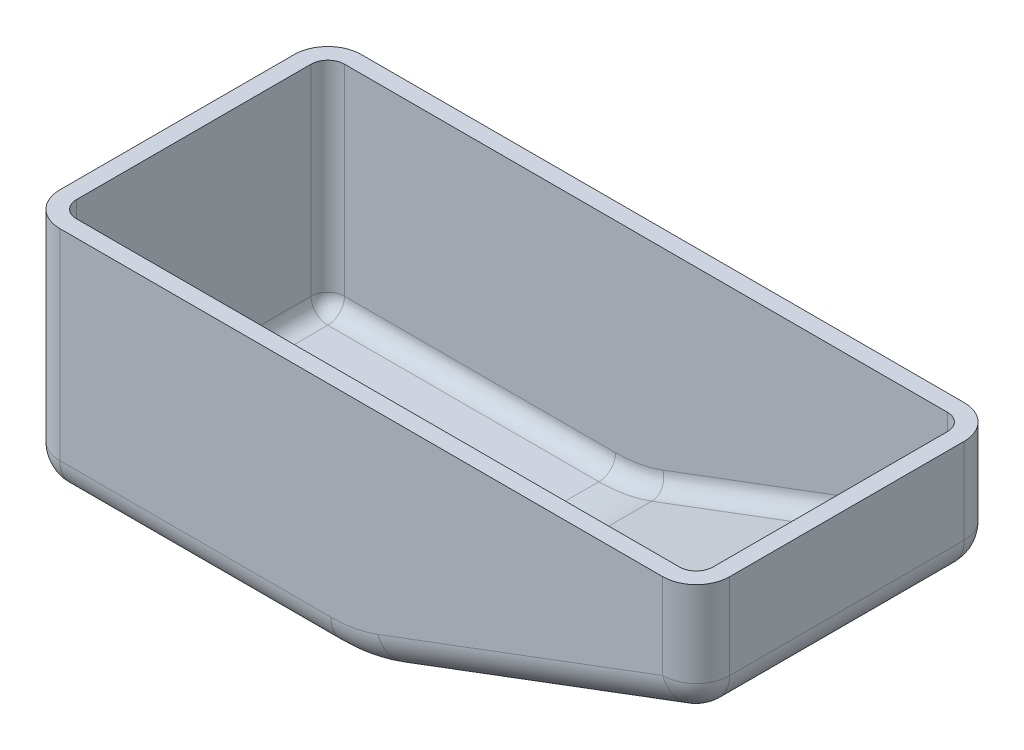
from build123d import *
from OCP.BRepFilletAPI import BRepFilletAPI_MakeFillet

# Parameters (mm, degrees)
BOSS_EXTRUDE1_DEPTH = 22.86
FILLET1_R1          = 25.4
FILLET1_R2          = 5.08
FILLET2_R           = 5.08
SHELL1_T            = -2.54


with BuildPart() as part:
    # Sketch1 → Boss-Extrude1 (new, symmetric)
    with BuildSketch(Plane.XY):
        Polygon((0, 0), (101.6, 0), (101.6, -16.51), (50.8, -35.56), (0, -35.56), align=None)
    extrude(amount=BOSS_EXTRUDE1_DEPTH, both=True)

    # Fillet1: one fillet with a radius per group of edges: ONE call of the kernel's fillet builder (fillet() takes one radius for all edges)
    fillet1_edges_1 = [part.edges().sort_by_distance(p)[0] for p in [
        (50.8, -35.56, 0),
    ]]
    fillet1_edges_2 = [part.edges().sort_by_distance(p)[0] for p in [
        (0, -35.56, 0),
        (101.6, -16.51, 0),
    ]]
    fillet1 = BRepFilletAPI_MakeFillet(part.part.solid().wrapped)
    for e in fillet1_edges_1:
        fillet1.Add(FILLET1_R1, e.wrapped)
    for e in fillet1_edges_2:
        fillet1.Add(FILLET1_R2, e.wrapped)
    add(Compound.cast(fillet1.Shape()), mode=Mode.REPLACE)

    # Fillet2
    fillet2_edges = [part.edges().sort_by_distance(p)[0] for p in [
        (101.6, -6.494778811, -22.86),
        (101.6, -6.494778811, 22.86),
        (76.708172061, -25.844435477, -22.86),
        (25.637050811, -35.56, -22.86),
        (50.726091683, -35.152420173, -22.86),
        (1.487897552, -34.072102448, -22.86),
        (100.695382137, -15.883099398, -22.86),
        (76.708172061, -25.844435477, 22.86),
        (25.637050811, -35.56, 22.86),
        (50.726091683, -35.152420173, 22.86),
        (1.487897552, -34.072102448, 22.86),
        (100.695382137, -15.883099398, 22.86),
        (0, -15.24, 22.86),
        (0, -15.24, -22.86),
    ]]
    fillet(fillet2_edges, radius=FILLET2_R)

    # Shell1
    shell1_openings = [part.faces().sort_by_distance(p)[0] for p in [
        (50.8, 0, 0),
    ]]
    offset(amount=SHELL1_T, openings=shell1_openings, kind=Kind.INTERSECTION)


solid = part.part
